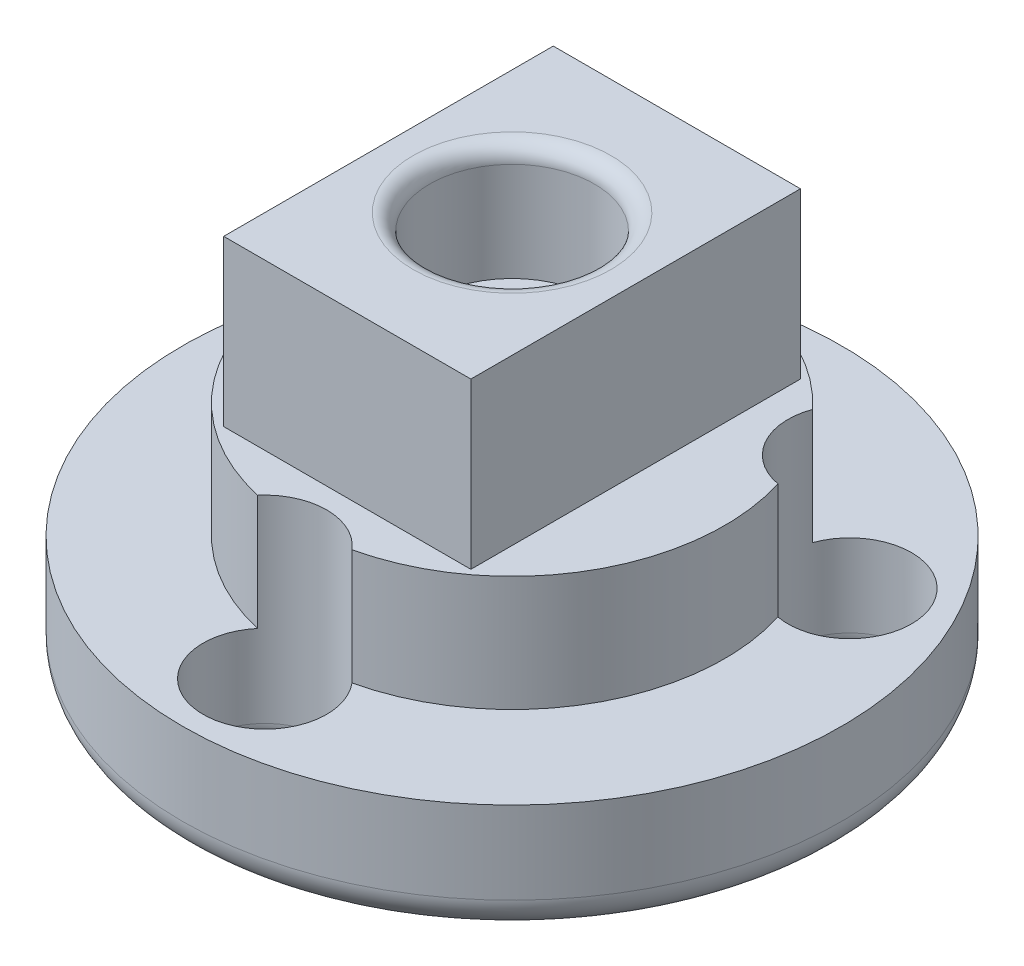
ISO-10303-21;
HEADER;
FILE_DESCRIPTION(('STEP AP214'),'2;1');
FILE_NAME('part.step','',(''),(''),'','','');
FILE_SCHEMA(('AUTOMOTIVE_DESIGN { 1 0 10303 214 1 1 1 1 }'));
ENDSEC;
DATA;
#1=APPLICATION_CONTEXT('core data for automotive mechanical design processes');
#2=APPLICATION_PROTOCOL_DEFINITION('international standard','automotive_design',2000,#1);
#3=PRODUCT_CONTEXT('',#1,'mechanical');
#4=PRODUCT('Part','Part','',(#3));
#5=PRODUCT_RELATED_PRODUCT_CATEGORY('part','',(#4));
#6=PRODUCT_DEFINITION_FORMATION('','',#4);
#7=PRODUCT_DEFINITION_CONTEXT('part definition',#1,'design');
#8=PRODUCT_DEFINITION('design','',#6,#7);
#9=PRODUCT_DEFINITION_SHAPE('','',#8);
#10=(LENGTH_UNIT() NAMED_UNIT(*) SI_UNIT(.MILLI.,.METRE.));
#11=(NAMED_UNIT(*) PLANE_ANGLE_UNIT() SI_UNIT($,.RADIAN.));
#12=(NAMED_UNIT(*) SI_UNIT($,.STERADIAN.) SOLID_ANGLE_UNIT());
#13=UNCERTAINTY_MEASURE_WITH_UNIT(LENGTH_MEASURE(1.E-05),#10,'distance_accuracy_value','');
#14=(GEOMETRIC_REPRESENTATION_CONTEXT(3) GLOBAL_UNCERTAINTY_ASSIGNED_CONTEXT((#13)) GLOBAL_UNIT_ASSIGNED_CONTEXT((#10,
#11,#12)) REPRESENTATION_CONTEXT('',''));
#15=CARTESIAN_POINT('',(0.,0.,0.));
#16=DIRECTION('',(0.,0.,1.));
#17=DIRECTION('',(1.,0.,0.));
#18=AXIS2_PLACEMENT_3D('',#15,#16,#17);
#19=CARTESIAN_POINT('',(0.,14.,0.));
#20=DIRECTION('',(0.,-1.,0.));
#21=DIRECTION('',(0.,0.,-1.));
#22=AXIS2_PLACEMENT_3D('',#19,#20,#21);
#23=CYLINDRICAL_SURFACE('',#22,12.9);
#24=CARTESIAN_POINT('',(0.,7.,0.));
#25=DIRECTION('',(0.,1.,0.));
#26=DIRECTION('',(0.,0.,1.));
#27=AXIS2_PLACEMENT_3D('',#24,#25,#26);
#28=CIRCLE('',#27,12.9);
#29=CARTESIAN_POINT('',(-12.324658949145,7.,-3.8095645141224));
#30=VERTEX_POINT('',#29);
#31=CARTESIAN_POINT('',(-2.86314982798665,7.,12.57825));
#32=VERTEX_POINT('',#31);
#33=EDGE_CURVE('E236',#30,#32,#28,.T.);
#34=ORIENTED_EDGE('',*,*,#33,.T.);
#35=DIRECTION('',(0.,-1.,0.));
#36=VECTOR('',#35,1.);
#37=CARTESIAN_POINT('',(-2.86314982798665,7.,12.57825));
#38=LINE('',#37,#36);
#39=CARTESIAN_POINT('',(-2.86314982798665,14.,12.57825));
#40=VERTEX_POINT('',#39);
#41=EDGE_CURVE('E219',#32,#40,#38,.F.);
#42=ORIENTED_EDGE('',*,*,#41,.T.);
#43=CARTESIAN_POINT('',(0.,14.,0.));
#44=DIRECTION('',(0.,1.,0.));
#45=DIRECTION('',(0.,0.,1.));
#46=AXIS2_PLACEMENT_3D('',#43,#44,#45);
#47=CIRCLE('',#46,12.9);
#48=CARTESIAN_POINT('',(-12.324658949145,14.,-3.8095645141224));
#49=VERTEX_POINT('',#48);
#50=EDGE_CURVE('E223',#49,#40,#47,.T.);
#51=ORIENTED_EDGE('',*,*,#50,.F.);
#52=DIRECTION('',(0.,-1.,0.));
#53=VECTOR('',#52,1.);
#54=CARTESIAN_POINT('',(-12.324658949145,7.,-3.8095645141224));
#55=LINE('',#54,#53);
#56=EDGE_CURVE('E189',#49,#30,#55,.T.);
#57=ORIENTED_EDGE('',*,*,#56,.T.);
#58=EDGE_LOOP('',(#34,#42,#51,#57));
#59=FACE_BOUND('',#58,.T.);
#60=ADVANCED_FACE('F45',(#59),#23,.T.);
#61=CARTESIAN_POINT('',(2.86314982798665,14.,12.57825));
#62=VERTEX_POINT('',#61);
#63=CARTESIAN_POINT('',(12.3246589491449,14.,-3.80956451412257));
#64=VERTEX_POINT('',#63);
#65=EDGE_CURVE('E224',#62,#64,#47,.T.);
#66=ORIENTED_EDGE('',*,*,#65,.F.);
#67=DIRECTION('',(0.,-1.,0.));
#68=VECTOR('',#67,1.);
#69=CARTESIAN_POINT('',(2.86314982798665,7.,12.57825));
#70=LINE('',#69,#68);
#71=CARTESIAN_POINT('',(2.86314982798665,7.,12.57825));
#72=VERTEX_POINT('',#71);
#73=EDGE_CURVE('E212',#62,#72,#70,.T.);
#74=ORIENTED_EDGE('',*,*,#73,.T.);
#75=CARTESIAN_POINT('',(12.3246589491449,7.,-3.80956451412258));
#76=VERTEX_POINT('',#75);
#77=EDGE_CURVE('E230',#72,#76,#28,.T.);
#78=ORIENTED_EDGE('',*,*,#77,.T.);
#79=DIRECTION('',(0.,-1.,0.));
#80=VECTOR('',#79,1.);
#81=CARTESIAN_POINT('',(12.3246589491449,7.,-3.80956451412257));
#82=LINE('',#81,#80);
#83=EDGE_CURVE('E208',#76,#64,#82,.F.);
#84=ORIENTED_EDGE('',*,*,#83,.T.);
#85=EDGE_LOOP('',(#66,#74,#78,#84));
#86=FACE_BOUND('',#85,.T.);
#87=ADVANCED_FACE('F319',(#86),#23,.T.);
#88=CARTESIAN_POINT('',(0.,7.,0.));
#89=DIRECTION('',(0.,-1.,0.));
#90=DIRECTION('',(0.,0.,-1.));
#91=AXIS2_PLACEMENT_3D('',#88,#89,#90);
#92=CYLINDRICAL_SURFACE('',#91,20.);
#93=CARTESIAN_POINT('',(0.,2.,0.));
#94=DIRECTION('',(0.,1.,0.));
#95=DIRECTION('',(0.,0.,1.));
#96=AXIS2_PLACEMENT_3D('',#93,#94,#95);
#97=CIRCLE('',#96,20.);
#98=CARTESIAN_POINT('',(0.,2.,20.));
#99=VERTEX_POINT('',#98);
#100=EDGE_CURVE('E11',#99,#99,#97,.T.);
#101=ORIENTED_EDGE('',*,*,#100,.T.);
#102=EDGE_LOOP('',(#101));
#103=FACE_BOUND('',#102,.T.);
#104=CARTESIAN_POINT('',(0.,7.,0.));
#105=DIRECTION('',(0.,1.,0.));
#106=DIRECTION('',(0.,0.,1.));
#107=AXIS2_PLACEMENT_3D('',#104,#105,#106);
#108=CIRCLE('',#107,20.);
#109=CARTESIAN_POINT('',(0.,7.,20.));
#110=VERTEX_POINT('',#109);
#111=EDGE_CURVE('E228',#110,#110,#108,.T.);
#112=ORIENTED_EDGE('',*,*,#111,.F.);
#113=EDGE_LOOP('',(#112));
#114=FACE_BOUND('',#113,.T.);
#115=ADVANCED_FACE('F326',(#103,#114),#92,.T.);
#116=CARTESIAN_POINT('',(0.,7.,0.));
#117=DIRECTION('',(0.,1.,0.));
#118=DIRECTION('',(0.,0.,1.));
#119=AXIS2_PLACEMENT_3D('',#116,#117,#118);
#120=PLANE('',#119);
#121=CARTESIAN_POINT('',(0.,7.,15.));
#122=DIRECTION('',(0.,1.,0.));
#123=DIRECTION('',(0.,0.,1.));
#124=AXIS2_PLACEMENT_3D('',#121,#122,#123);
#125=CIRCLE('',#124,3.75);
#126=EDGE_CURVE('E216',#32,#72,#125,.T.);
#127=ORIENTED_EDGE('',*,*,#126,.F.);
#128=ORIENTED_EDGE('',*,*,#33,.F.);
#129=CARTESIAN_POINT('',(-12.9903810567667,7.,-7.49999999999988));
#130=DIRECTION('',(0.,1.,0.));
#131=DIRECTION('',(0.,0.,1.));
#132=AXIS2_PLACEMENT_3D('',#129,#130,#131);
#133=CIRCLE('',#132,3.75);
#134=CARTESIAN_POINT('',(-9.46150912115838,7.,-8.7686854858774));
#135=VERTEX_POINT('',#134);
#136=EDGE_CURVE('E194',#135,#30,#133,.T.);
#137=ORIENTED_EDGE('',*,*,#136,.F.);
#138=CARTESIAN_POINT('',(9.46150912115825,7.,-8.76868548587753));
#139=VERTEX_POINT('',#138);
#140=EDGE_CURVE('E235',#139,#135,#28,.T.);
#141=ORIENTED_EDGE('',*,*,#140,.F.);
#142=CARTESIAN_POINT('',(12.9903810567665,7.,-7.50000000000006));
#143=DIRECTION('',(0.,1.,0.));
#144=DIRECTION('',(0.,0.,1.));
#145=AXIS2_PLACEMENT_3D('',#142,#143,#144);
#146=CIRCLE('',#145,3.75);
#147=EDGE_CURVE('E205',#76,#139,#146,.T.);
#148=ORIENTED_EDGE('',*,*,#147,.F.);
#149=ORIENTED_EDGE('',*,*,#77,.F.);
#150=EDGE_LOOP('',(#127,#128,#137,#141,#148,#149));
#151=FACE_BOUND('',#150,.T.);
#152=ORIENTED_EDGE('',*,*,#111,.T.);
#153=EDGE_LOOP('',(#152));
#154=FACE_BOUND('',#153,.T.);
#155=ADVANCED_FACE('F341',(#151,#154),#120,.T.);
#156=CARTESIAN_POINT('',(0.,0.,0.));
#157=DIRECTION('',(0.,1.,0.));
#158=DIRECTION('',(0.,0.,1.));
#159=AXIS2_PLACEMENT_3D('',#156,#157,#158);
#160=PLANE('',#159);
#161=CARTESIAN_POINT('',(0.,0.,0.));
#162=DIRECTION('',(0.,1.,0.));
#163=DIRECTION('',(0.,0.,1.));
#164=AXIS2_PLACEMENT_3D('',#161,#162,#163);
#165=CIRCLE('',#164,18.);
#166=CARTESIAN_POINT('',(17.5505065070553,0.,-3.99746436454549));
#167=VERTEX_POINT('',#166);
#168=CARTESIAN_POINT('',(5.3133475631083,0.,17.1979166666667));
#169=VERTEX_POINT('',#168);
#170=EDGE_CURVE('E67',#167,#169,#165,.F.);
#171=ORIENTED_EDGE('',*,*,#170,.T.);
#172=CARTESIAN_POINT('',(0.,0.,15.));
#173=DIRECTION('',(0.,1.,0.));
#174=DIRECTION('',(0.,0.,1.));
#175=AXIS2_PLACEMENT_3D('',#172,#173,#174);
#176=CIRCLE('',#175,5.75);
#177=CARTESIAN_POINT('',(-5.3133475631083,0.,17.1979166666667));
#178=VERTEX_POINT('',#177);
#179=EDGE_CURVE('E268',#169,#178,#176,.T.);
#180=ORIENTED_EDGE('',*,*,#179,.T.);
#181=CARTESIAN_POINT('',(0.,0.,0.));
#182=DIRECTION('',(0.,1.,0.));
#183=DIRECTION('',(0.,0.,1.));
#184=AXIS2_PLACEMENT_3D('',#181,#182,#183);
#185=CIRCLE('',#184,18.);
#186=CARTESIAN_POINT('',(-17.5505065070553,0.,-3.99746436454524));
#187=VERTEX_POINT('',#186);
#188=EDGE_CURVE('E263',#178,#187,#185,.F.);
#189=ORIENTED_EDGE('',*,*,#188,.T.);
#190=CARTESIAN_POINT('',(-12.9903810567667,0.,-7.49999999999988));
#191=DIRECTION('',(0.,1.,0.));
#192=DIRECTION('',(0.,0.,1.));
#193=AXIS2_PLACEMENT_3D('',#190,#191,#192);
#194=CIRCLE('',#193,5.75);
#195=CARTESIAN_POINT('',(-12.2371589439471,0.,-13.2004523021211));
#196=VERTEX_POINT('',#195);
#197=EDGE_CURVE('E260',#187,#196,#194,.T.);
#198=ORIENTED_EDGE('',*,*,#197,.T.);
#199=CARTESIAN_POINT('',(0.,0.,0.));
#200=DIRECTION('',(0.,1.,0.));
#201=DIRECTION('',(0.,0.,1.));
#202=AXIS2_PLACEMENT_3D('',#199,#200,#201);
#203=CIRCLE('',#202,18.);
#204=CARTESIAN_POINT('',(12.2371589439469,0.,-13.2004523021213));
#205=VERTEX_POINT('',#204);
#206=EDGE_CURVE('E254',#196,#205,#203,.F.);
#207=ORIENTED_EDGE('',*,*,#206,.T.);
#208=CARTESIAN_POINT('',(12.9903810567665,0.,-7.50000000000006));
#209=DIRECTION('',(0.,1.,0.));
#210=DIRECTION('',(0.,0.,1.));
#211=AXIS2_PLACEMENT_3D('',#208,#209,#210);
#212=CIRCLE('',#211,5.75);
#213=EDGE_CURVE('E257',#205,#167,#212,.T.);
#214=ORIENTED_EDGE('',*,*,#213,.T.);
#215=EDGE_LOOP('',(#171,#180,#189,#198,#207,#214));
#216=FACE_BOUND('',#215,.T.);
#217=ADVANCED_FACE('F333',(#216),#160,.F.);
#218=CARTESIAN_POINT('',(9.46150912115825,14.,-8.76868548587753));
#219=VERTEX_POINT('',#218);
#220=CARTESIAN_POINT('',(-9.46150912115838,14.,-8.7686854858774));
#221=VERTEX_POINT('',#220);
#222=EDGE_CURVE('E229',#219,#221,#47,.T.);
#223=ORIENTED_EDGE('',*,*,#222,.F.);
#224=DIRECTION('',(0.,-1.,0.));
#225=VECTOR('',#224,1.);
#226=CARTESIAN_POINT('',(9.46150912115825,7.,-8.76868548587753));
#227=LINE('',#226,#225);
#228=EDGE_CURVE('E201',#219,#139,#227,.T.);
#229=ORIENTED_EDGE('',*,*,#228,.T.);
#230=ORIENTED_EDGE('',*,*,#140,.T.);
#231=DIRECTION('',(0.,-1.,0.));
#232=VECTOR('',#231,1.);
#233=CARTESIAN_POINT('',(-9.46150912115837,7.,-8.7686854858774));
#234=LINE('',#233,#232);
#235=EDGE_CURVE('E197',#135,#221,#234,.F.);
#236=ORIENTED_EDGE('',*,*,#235,.T.);
#237=EDGE_LOOP('',(#223,#229,#230,#236));
#238=FACE_BOUND('',#237,.T.);
#239=ADVANCED_FACE('F322',(#238),#23,.T.);
#240=CARTESIAN_POINT('',(0.,14.,0.));
#241=DIRECTION('',(0.,1.,0.));
#242=DIRECTION('',(0.,0.,1.));
#243=AXIS2_PLACEMENT_3D('',#240,#241,#242);
#244=PLANE('',#243);
#245=DIRECTION('',(0.,0.,1.));
#246=VECTOR('',#245,1.);
#247=CARTESIAN_POINT('',(-7.5,14.,-10.));
#248=LINE('',#247,#246);
#249=CARTESIAN_POINT('',(-7.5,14.,-10.));
#250=VERTEX_POINT('',#249);
#251=CARTESIAN_POINT('',(-7.5,14.,10.));
#252=VERTEX_POINT('',#251);
#253=EDGE_CURVE('E174',#250,#252,#248,.T.);
#254=ORIENTED_EDGE('',*,*,#253,.F.);
#255=DIRECTION('',(-1.,0.,0.));
#256=VECTOR('',#255,1.);
#257=CARTESIAN_POINT('',(-7.5,14.,-10.));
#258=LINE('',#257,#256);
#259=CARTESIAN_POINT('',(7.5,14.,-10.));
#260=VERTEX_POINT('',#259);
#261=EDGE_CURVE('E171',#260,#250,#258,.T.);
#262=ORIENTED_EDGE('',*,*,#261,.F.);
#263=DIRECTION('',(0.,0.,-1.));
#264=VECTOR('',#263,1.);
#265=CARTESIAN_POINT('',(7.5,14.,-10.));
#266=LINE('',#265,#264);
#267=CARTESIAN_POINT('',(7.5,14.,10.));
#268=VERTEX_POINT('',#267);
#269=EDGE_CURVE('E419',#268,#260,#266,.T.);
#270=ORIENTED_EDGE('',*,*,#269,.F.);
#271=DIRECTION('',(1.,0.,0.));
#272=VECTOR('',#271,1.);
#273=CARTESIAN_POINT('',(-7.5,14.,10.));
#274=LINE('',#273,#272);
#275=EDGE_CURVE('E408',#252,#268,#274,.T.);
#276=ORIENTED_EDGE('',*,*,#275,.F.);
#277=EDGE_LOOP('',(#254,#262,#270,#276));
#278=FACE_BOUND('',#277,.T.);
#279=CARTESIAN_POINT('',(0.,14.,15.));
#280=DIRECTION('',(0.,1.,0.));
#281=DIRECTION('',(0.,0.,1.));
#282=AXIS2_PLACEMENT_3D('',#279,#280,#281);
#283=CIRCLE('',#282,3.75);
#284=EDGE_CURVE('E234',#62,#40,#283,.T.);
#285=ORIENTED_EDGE('',*,*,#284,.F.);
#286=ORIENTED_EDGE('',*,*,#65,.T.);
#287=CARTESIAN_POINT('',(12.9903810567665,14.,-7.50000000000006));
#288=DIRECTION('',(0.,-1.,0.));
#289=DIRECTION('',(0.,0.,-1.));
#290=AXIS2_PLACEMENT_3D('',#287,#288,#289);
#291=CIRCLE('',#290,3.75);
#292=EDGE_CURVE('E181',#64,#219,#291,.T.);
#293=ORIENTED_EDGE('',*,*,#292,.T.);
#294=ORIENTED_EDGE('',*,*,#222,.T.);
#295=CARTESIAN_POINT('',(-12.9903810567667,14.,-7.49999999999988));
#296=DIRECTION('',(0.,-1.,0.));
#297=DIRECTION('',(0.,0.,-1.));
#298=AXIS2_PLACEMENT_3D('',#295,#296,#297);
#299=CIRCLE('',#298,3.75);
#300=EDGE_CURVE('E176',#221,#49,#299,.T.);
#301=ORIENTED_EDGE('',*,*,#300,.T.);
#302=ORIENTED_EDGE('',*,*,#50,.T.);
#303=EDGE_LOOP('',(#285,#286,#293,#294,#301,#302));
#304=FACE_BOUND('',#303,.T.);
#305=ADVANCED_FACE('F332',(#278,#304),#244,.T.);
#306=CARTESIAN_POINT('',(-12.9903810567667,14.,-7.49999999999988));
#307=DIRECTION('',(0.,-1.,0.));
#308=DIRECTION('',(0.,0.,-1.));
#309=AXIS2_PLACEMENT_3D('',#306,#307,#308);
#310=CYLINDRICAL_SURFACE('',#309,3.75);
#311=CARTESIAN_POINT('',(-12.9903810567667,2.,-7.49999999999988));
#312=DIRECTION('',(0.,1.,0.));
#313=DIRECTION('',(0.,0.,1.));
#314=AXIS2_PLACEMENT_3D('',#311,#312,#313);
#315=CIRCLE('',#314,3.75);
#316=CARTESIAN_POINT('',(-12.9903810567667,2.,-3.74999999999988));
#317=VERTEX_POINT('',#316);
#318=EDGE_CURVE('E271',#317,#317,#315,.F.);
#319=ORIENTED_EDGE('',*,*,#318,.T.);
#320=EDGE_LOOP('',(#319));
#321=FACE_BOUND('',#320,.T.);
#322=ORIENTED_EDGE('',*,*,#136,.T.);
#323=ORIENTED_EDGE('',*,*,#56,.F.);
#324=ORIENTED_EDGE('',*,*,#300,.F.);
#325=ORIENTED_EDGE('',*,*,#235,.F.);
#326=EDGE_LOOP('',(#322,#323,#324,#325));
#327=FACE_BOUND('',#326,.T.);
#328=ADVANCED_FACE('F339',(#321,#327),#310,.F.);
#329=CARTESIAN_POINT('',(12.9903810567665,14.,-7.50000000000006));
#330=DIRECTION('',(0.,-1.,0.));
#331=DIRECTION('',(0.,0.,-1.));
#332=AXIS2_PLACEMENT_3D('',#329,#330,#331);
#333=CYLINDRICAL_SURFACE('',#332,3.75);
#334=CARTESIAN_POINT('',(12.9903810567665,2.,-7.50000000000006));
#335=DIRECTION('',(0.,1.,0.));
#336=DIRECTION('',(0.,0.,1.));
#337=AXIS2_PLACEMENT_3D('',#334,#335,#336);
#338=CIRCLE('',#337,3.75);
#339=CARTESIAN_POINT('',(12.9903810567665,2.,-3.75000000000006));
#340=VERTEX_POINT('',#339);
#341=EDGE_CURVE('E59',#340,#340,#338,.F.);
#342=ORIENTED_EDGE('',*,*,#341,.T.);
#343=EDGE_LOOP('',(#342));
#344=FACE_BOUND('',#343,.T.);
#345=ORIENTED_EDGE('',*,*,#147,.T.);
#346=ORIENTED_EDGE('',*,*,#228,.F.);
#347=ORIENTED_EDGE('',*,*,#292,.F.);
#348=ORIENTED_EDGE('',*,*,#83,.F.);
#349=EDGE_LOOP('',(#345,#346,#347,#348));
#350=FACE_BOUND('',#349,.T.);
#351=ADVANCED_FACE('F364',(#344,#350),#333,.F.);
#352=CARTESIAN_POINT('',(0.,14.,15.));
#353=DIRECTION('',(0.,-1.,0.));
#354=DIRECTION('',(0.,0.,-1.));
#355=AXIS2_PLACEMENT_3D('',#352,#353,#354);
#356=CYLINDRICAL_SURFACE('',#355,3.75);
#357=CARTESIAN_POINT('',(0.,2.,15.));
#358=DIRECTION('',(0.,1.,0.));
#359=DIRECTION('',(0.,0.,1.));
#360=AXIS2_PLACEMENT_3D('',#357,#358,#359);
#361=CIRCLE('',#360,3.75);
#362=CARTESIAN_POINT('',(0.,2.,18.75));
#363=VERTEX_POINT('',#362);
#364=EDGE_CURVE('E250',#363,#363,#361,.F.);
#365=ORIENTED_EDGE('',*,*,#364,.T.);
#366=EDGE_LOOP('',(#365));
#367=FACE_BOUND('',#366,.T.);
#368=ORIENTED_EDGE('',*,*,#126,.T.);
#369=ORIENTED_EDGE('',*,*,#73,.F.);
#370=ORIENTED_EDGE('',*,*,#284,.T.);
#371=ORIENTED_EDGE('',*,*,#41,.F.);
#372=EDGE_LOOP('',(#368,#369,#370,#371));
#373=FACE_BOUND('',#372,.T.);
#374=ADVANCED_FACE('F357',(#367,#373),#356,.F.);
#375=CARTESIAN_POINT('',(-7.5,24.,-10.));
#376=DIRECTION('',(1.,0.,0.));
#377=DIRECTION('',(0.,0.,-1.));
#378=AXIS2_PLACEMENT_3D('',#375,#376,#377);
#379=PLANE('',#378);
#380=ORIENTED_EDGE('',*,*,#253,.T.);
#381=DIRECTION('',(0.,-1.,0.));
#382=VECTOR('',#381,1.);
#383=CARTESIAN_POINT('',(-7.5,24.,10.));
#384=LINE('',#383,#382);
#385=CARTESIAN_POINT('',(-7.5,24.,10.));
#386=VERTEX_POINT('',#385);
#387=EDGE_CURVE('E153',#386,#252,#384,.T.);
#388=ORIENTED_EDGE('',*,*,#387,.F.);
#389=DIRECTION('',(0.,0.,1.));
#390=VECTOR('',#389,1.);
#391=CARTESIAN_POINT('',(-7.5,24.,-10.));
#392=LINE('',#391,#390);
#393=CARTESIAN_POINT('',(-7.5,24.,-10.));
#394=VERTEX_POINT('',#393);
#395=EDGE_CURVE('E161',#394,#386,#392,.T.);
#396=ORIENTED_EDGE('',*,*,#395,.F.);
#397=DIRECTION('',(0.,-1.,0.));
#398=VECTOR('',#397,1.);
#399=CARTESIAN_POINT('',(-7.5,24.,-10.));
#400=LINE('',#399,#398);
#401=EDGE_CURVE('E415',#394,#250,#400,.T.);
#402=ORIENTED_EDGE('',*,*,#401,.T.);
#403=EDGE_LOOP('',(#380,#388,#396,#402));
#404=FACE_BOUND('',#403,.T.);
#405=ADVANCED_FACE('F173',(#404),#379,.F.);
#406=CARTESIAN_POINT('',(-7.5,24.,10.));
#407=DIRECTION('',(0.,0.,-1.));
#408=DIRECTION('',(-1.,0.,0.));
#409=AXIS2_PLACEMENT_3D('',#406,#407,#408);
#410=PLANE('',#409);
#411=ORIENTED_EDGE('',*,*,#275,.T.);
#412=DIRECTION('',(0.,-1.,0.));
#413=VECTOR('',#412,1.);
#414=CARTESIAN_POINT('',(7.5,24.,10.));
#415=LINE('',#414,#413);
#416=CARTESIAN_POINT('',(7.5,24.,10.));
#417=VERTEX_POINT('',#416);
#418=EDGE_CURVE('E156',#417,#268,#415,.T.);
#419=ORIENTED_EDGE('',*,*,#418,.F.);
#420=DIRECTION('',(1.,0.,0.));
#421=VECTOR('',#420,1.);
#422=CARTESIAN_POINT('',(-7.5,24.,10.));
#423=LINE('',#422,#421);
#424=EDGE_CURVE('E148',#386,#417,#423,.T.);
#425=ORIENTED_EDGE('',*,*,#424,.F.);
#426=ORIENTED_EDGE('',*,*,#387,.T.);
#427=EDGE_LOOP('',(#411,#419,#425,#426));
#428=FACE_BOUND('',#427,.T.);
#429=ADVANCED_FACE('F151',(#428),#410,.F.);
#430=CARTESIAN_POINT('',(7.5,24.,-10.));
#431=DIRECTION('',(-1.,0.,0.));
#432=DIRECTION('',(0.,0.,1.));
#433=AXIS2_PLACEMENT_3D('',#430,#431,#432);
#434=PLANE('',#433);
#435=ORIENTED_EDGE('',*,*,#269,.T.);
#436=DIRECTION('',(0.,-1.,0.));
#437=VECTOR('',#436,1.);
#438=CARTESIAN_POINT('',(7.5,24.,-10.));
#439=LINE('',#438,#437);
#440=CARTESIAN_POINT('',(7.5,24.,-10.));
#441=VERTEX_POINT('',#440);
#442=EDGE_CURVE('E183',#441,#260,#439,.T.);
#443=ORIENTED_EDGE('',*,*,#442,.F.);
#444=DIRECTION('',(0.,0.,-1.));
#445=VECTOR('',#444,1.);
#446=CARTESIAN_POINT('',(7.5,24.,-10.));
#447=LINE('',#446,#445);
#448=EDGE_CURVE('E160',#417,#441,#447,.T.);
#449=ORIENTED_EDGE('',*,*,#448,.F.);
#450=ORIENTED_EDGE('',*,*,#418,.T.);
#451=EDGE_LOOP('',(#435,#443,#449,#450));
#452=FACE_BOUND('',#451,.T.);
#453=ADVANCED_FACE('F381',(#452),#434,.F.);
#454=CARTESIAN_POINT('',(-7.5,24.,-10.));
#455=DIRECTION('',(0.,0.,1.));
#456=DIRECTION('',(1.,0.,0.));
#457=AXIS2_PLACEMENT_3D('',#454,#455,#456);
#458=PLANE('',#457);
#459=ORIENTED_EDGE('',*,*,#261,.T.);
#460=ORIENTED_EDGE('',*,*,#401,.F.);
#461=DIRECTION('',(-1.,0.,0.));
#462=VECTOR('',#461,1.);
#463=CARTESIAN_POINT('',(-7.5,24.,-10.));
#464=LINE('',#463,#462);
#465=EDGE_CURVE('E166',#441,#394,#464,.T.);
#466=ORIENTED_EDGE('',*,*,#465,.F.);
#467=ORIENTED_EDGE('',*,*,#442,.T.);
#468=EDGE_LOOP('',(#459,#460,#466,#467));
#469=FACE_BOUND('',#468,.T.);
#470=ADVANCED_FACE('F384',(#469),#458,.F.);
#471=CARTESIAN_POINT('',(0.,24.,0.));
#472=DIRECTION('',(0.,1.,0.));
#473=DIRECTION('',(0.,0.,1.));
#474=AXIS2_PLACEMENT_3D('',#471,#472,#473);
#475=PLANE('',#474);
#476=CARTESIAN_POINT('',(0.,24.,0.));
#477=DIRECTION('',(0.,1.,0.));
#478=DIRECTION('',(0.,0.,1.));
#479=AXIS2_PLACEMENT_3D('',#476,#477,#478);
#480=CIRCLE('',#479,6.);
#481=CARTESIAN_POINT('',(0.,24.,6.));
#482=VERTEX_POINT('',#481);
#483=EDGE_CURVE('E246',#482,#482,#480,.F.);
#484=ORIENTED_EDGE('',*,*,#483,.T.);
#485=EDGE_LOOP('',(#484));
#486=FACE_BOUND('',#485,.T.);
#487=ORIENTED_EDGE('',*,*,#395,.T.);
#488=ORIENTED_EDGE('',*,*,#424,.T.);
#489=ORIENTED_EDGE('',*,*,#448,.T.);
#490=ORIENTED_EDGE('',*,*,#465,.T.);
#491=EDGE_LOOP('',(#487,#488,#489,#490));
#492=FACE_BOUND('',#491,.T.);
#493=ADVANCED_FACE('F164',(#486,#492),#475,.T.);
#494=CARTESIAN_POINT('',(0.,17.,0.));
#495=DIRECTION('',(0.,1.,0.));
#496=DIRECTION('',(0.,0.,1.));
#497=AXIS2_PLACEMENT_3D('',#494,#495,#496);
#498=CYLINDRICAL_SURFACE('',#497,5.);
#499=CARTESIAN_POINT('',(0.,23.,0.));
#500=DIRECTION('',(0.,1.,0.));
#501=DIRECTION('',(0.,0.,1.));
#502=AXIS2_PLACEMENT_3D('',#499,#500,#501);
#503=CIRCLE('',#502,5.);
#504=CARTESIAN_POINT('',(0.,23.,5.));
#505=VERTEX_POINT('',#504);
#506=EDGE_CURVE('E242',#505,#505,#503,.T.);
#507=ORIENTED_EDGE('',*,*,#506,.T.);
#508=EDGE_LOOP('',(#507));
#509=FACE_BOUND('',#508,.T.);
#510=CARTESIAN_POINT('',(0.,17.,0.));
#511=DIRECTION('',(0.,1.,0.));
#512=DIRECTION('',(0.,0.,1.));
#513=AXIS2_PLACEMENT_3D('',#510,#511,#512);
#514=CIRCLE('',#513,5.);
#515=CARTESIAN_POINT('',(0.,17.,5.));
#516=VERTEX_POINT('',#515);
#517=EDGE_CURVE('E402',#516,#516,#514,.T.);
#518=ORIENTED_EDGE('',*,*,#517,.F.);
#519=EDGE_LOOP('',(#518));
#520=FACE_BOUND('',#519,.T.);
#521=ADVANCED_FACE('F391',(#509,#520),#498,.F.);
#522=CARTESIAN_POINT('',(0.,17.,0.));
#523=DIRECTION('',(0.,1.,0.));
#524=DIRECTION('',(0.,0.,1.));
#525=AXIS2_PLACEMENT_3D('',#522,#523,#524);
#526=PLANE('',#525);
#527=ORIENTED_EDGE('',*,*,#517,.T.);
#528=EDGE_LOOP('',(#527));
#529=FACE_BOUND('',#528,.T.);
#530=ADVANCED_FACE('F314',(#529),#526,.T.);
#531=CARTESIAN_POINT('',(0.,23.,0.));
#532=DIRECTION('',(0.,1.,0.));
#533=DIRECTION('',(0.,0.,1.));
#534=AXIS2_PLACEMENT_3D('',#531,#532,#533);
#535=TOROIDAL_SURFACE('',#534,6.,1.);
#536=ORIENTED_EDGE('',*,*,#483,.F.);
#537=EDGE_LOOP('',(#536));
#538=FACE_BOUND('',#537,.T.);
#539=ORIENTED_EDGE('',*,*,#506,.F.);
#540=EDGE_LOOP('',(#539));
#541=FACE_BOUND('',#540,.T.);
#542=ADVANCED_FACE('F309',(#538,#541),#535,.T.);
#543=CARTESIAN_POINT('',(-12.9903810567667,2.,-7.49999999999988));
#544=DIRECTION('',(0.,1.,0.));
#545=DIRECTION('',(0.,0.,1.));
#546=AXIS2_PLACEMENT_3D('',#543,#544,#545);
#547=TOROIDAL_SURFACE('',#546,5.75,2.);
#548=ORIENTED_EDGE('',*,*,#318,.F.);
#549=EDGE_LOOP('',(#548));
#550=FACE_BOUND('',#549,.T.);
#551=CARTESIAN_POINT('',(-17.5505065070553,0.,-3.99746436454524));
#552=CARTESIAN_POINT('',(-17.5512330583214,2.03152041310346E-09,-4.00078328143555));
#553=CARTESIAN_POINT('',(-17.5519578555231,1.56900906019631E-06,-4.00410260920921));
#554=CARTESIAN_POINT('',(-17.5994595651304,0.00020698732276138,-4.22219958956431));
#555=CARTESIAN_POINT('',(-17.6388881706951,0.00693803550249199,-4.43868291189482));
#556=CARTESIAN_POINT('',(-17.7020312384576,0.0306652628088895,-4.87347104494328));
#557=CARTESIAN_POINT('',(-17.7257319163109,0.0476704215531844,-5.09177728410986));
#558=CARTESIAN_POINT('',(-17.7566702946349,0.0893711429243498,-5.52973100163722));
#559=CARTESIAN_POINT('',(-17.7638403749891,0.114097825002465,-5.74938031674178));
#560=CARTESIAN_POINT('',(-17.7608477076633,0.168464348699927,-6.18795240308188));
#561=CARTESIAN_POINT('',(-17.7506841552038,0.19810441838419,-6.40687514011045));
#562=CARTESIAN_POINT('',(-17.7121315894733,0.259800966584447,-6.84625476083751));
#563=CARTESIAN_POINT('',(-17.6834635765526,0.291887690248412,-7.06668313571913));
#564=CARTESIAN_POINT('',(-17.6070636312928,0.354604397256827,-7.50448157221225));
#565=CARTESIAN_POINT('',(-17.5593291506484,0.385234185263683,-7.72185122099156));
#566=CARTESIAN_POINT('',(-17.444595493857,0.441091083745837,-8.1511388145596));
#567=CARTESIAN_POINT('',(-17.3776842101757,0.466341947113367,-8.36307693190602));
#568=CARTESIAN_POINT('',(-17.2243578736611,0.507839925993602,-8.78068105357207));
#569=CARTESIAN_POINT('',(-17.1379496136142,0.524090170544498,-8.98634921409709));
#570=CARTESIAN_POINT('',(-16.9534815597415,0.543943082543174,-9.3735698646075));
#571=CARTESIAN_POINT('',(-16.8568472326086,0.548429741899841,-9.55575494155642));
#572=CARTESIAN_POINT('',(-16.6481901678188,0.546596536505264,-9.91102781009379));
#573=CARTESIAN_POINT('',(-16.536167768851,0.540276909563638,-10.0841158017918));
#574=CARTESIAN_POINT('',(-16.2976555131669,0.517830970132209,-10.420051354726));
#575=CARTESIAN_POINT('',(-16.1711247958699,0.501676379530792,-10.582867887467));
#576=CARTESIAN_POINT('',(-15.9052178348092,0.461936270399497,-10.8966614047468));
#577=CARTESIAN_POINT('',(-15.7658390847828,0.438349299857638,-11.0476360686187));
#578=CARTESIAN_POINT('',(-15.4633747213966,0.384569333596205,-11.3492699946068));
#579=CARTESIAN_POINT('',(-15.2992813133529,0.353988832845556,-11.498846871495));
#580=CARTESIAN_POINT('',(-14.9589288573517,0.291389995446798,-11.7831214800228));
#581=CARTESIAN_POINT('',(-14.7826678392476,0.259371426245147,-11.9178167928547));
#582=CARTESIAN_POINT('',(-14.4195470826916,0.197382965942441,-12.1720387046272));
#583=CARTESIAN_POINT('',(-14.2327014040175,0.167410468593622,-12.2915847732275));
#584=CARTESIAN_POINT('',(-13.849587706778,0.112557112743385,-12.5156245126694));
#585=CARTESIAN_POINT('',(-13.6533240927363,0.0876739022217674,-12.6201251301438));
#586=CARTESIAN_POINT('',(-13.2585185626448,0.0464380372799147,-12.8113157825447));
#587=CARTESIAN_POINT('',(-13.0602073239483,0.0298591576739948,-12.8984340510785));
#588=CARTESIAN_POINT('',(-12.65759381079,0.00674917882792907,-13.0584789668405));
#589=CARTESIAN_POINT('',(-12.4533002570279,0.000204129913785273,-13.1314251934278));
#590=CARTESIAN_POINT('',(-12.2436335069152,1.56894978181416E-06,-13.1983900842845));
#591=CARTESIAN_POINT('',(-12.2403964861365,1.97100317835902E-09,-13.1994220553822));
#592=CARTESIAN_POINT('',(-12.2371589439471,0.,-13.2004523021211));
#593=B_SPLINE_CURVE_WITH_KNOTS('',3,(#551,#552,#553,#554,#555,#556,#557,#558,#559,#560,#561,
#562,#563,#564,#565,#566,#567,#568,#569,#570,#571,#572,#573,#574,#575,#576,#577,#578,#579,#580,
#581,#582,#583,#584,#585,#586,#587,#588,#589,#590,#591,#592),.UNSPECIFIED.,.F.,.F.,(4,2,2,2,2,2,
2,2,2,2,2,2,2,2,2,2,2,2,2,2,4),(0.,0.0101926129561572,0.669625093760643,1.32963475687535,
1.99233950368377,2.65507501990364,3.32804396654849,4.00110288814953,4.67112502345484,
5.3409140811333,5.95870137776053,6.5764750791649,7.19603348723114,7.81571300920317,
8.48721862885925,9.1588332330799,9.82957573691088,10.5000075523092,11.1510189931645,
11.8011245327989,11.811317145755),.UNSPECIFIED.);
#594=EDGE_CURVE('E49',#196,#187,#593,.F.);
#595=ORIENTED_EDGE('',*,*,#594,.F.);
#596=ORIENTED_EDGE('',*,*,#197,.F.);
#597=EDGE_LOOP('',(#595,#596));
#598=FACE_BOUND('',#597,.T.);
#599=ADVANCED_FACE('F304',(#550,#598),#547,.T.);
#600=CARTESIAN_POINT('',(12.9903810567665,2.,-7.50000000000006));
#601=DIRECTION('',(0.,1.,0.));
#602=DIRECTION('',(0.,0.,1.));
#603=AXIS2_PLACEMENT_3D('',#600,#601,#602);
#604=TOROIDAL_SURFACE('',#603,5.75,2.);
#605=ORIENTED_EDGE('',*,*,#341,.F.);
#606=EDGE_LOOP('',(#605));
#607=FACE_BOUND('',#606,.T.);
#608=CARTESIAN_POINT('',(12.2371589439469,0.,-13.2004523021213));
#609=CARTESIAN_POINT('',(12.24039648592,2.03152023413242E-09,-13.1994220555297));
#610=CARTESIAN_POINT('',(12.2436335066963,1.56900905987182E-06,-13.1983900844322));
#611=CARTESIAN_POINT('',(12.4562618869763,0.000206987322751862,-13.1304792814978));
#612=CARTESIAN_POINT('',(12.6634562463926,0.00693803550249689,-13.0563837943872));
#613=CARTESIAN_POINT('',(13.0715653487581,0.030665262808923,-12.8936732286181));
#614=CARTESIAN_POINT('',(13.2724744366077,0.0476704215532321,-12.8050454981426));
#615=CARTESIAN_POINT('',(13.6672226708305,0.0893711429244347,-12.6128620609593));
#616=CARTESIAN_POINT('',(13.861029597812,0.114097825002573,-12.5092468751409));
#617=CARTESIAN_POINT('',(14.2393478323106,0.16846434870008,-12.2873691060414));
#618=CARTESIAN_POINT('',(14.4238587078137,0.198104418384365,-12.1691058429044));
#619=CARTESIAN_POINT('',(14.7850963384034,0.259800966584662,-11.916028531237));
#620=CARTESIAN_POINT('',(14.9616589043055,0.291887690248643,-11.7809871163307));
#621=CARTESIAN_POINT('',(15.3026034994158,0.354604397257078,-11.4959236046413));
#622=CARTESIAN_POINT('',(15.4669838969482,0.38523418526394,-11.345899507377));
#623=CARTESIAN_POINT('',(15.781391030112,0.44109108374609,-11.0318934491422));
#624=CARTESIAN_POINT('',(15.9314791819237,0.466341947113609,-10.8679775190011));
#625=CARTESIAN_POINT('',(16.2164717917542,0.507839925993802,-10.5263909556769));
#626=CARTESIAN_POINT('',(16.3513815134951,0.524090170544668,-10.3487251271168));
#627=CARTESIAN_POINT('',(16.5944904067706,0.543943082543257,-9.99536078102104));
#628=CARTESIAN_POINT('',(16.7039501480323,0.548429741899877,-9.82058046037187));
#629=CARTESIAN_POINT('',(16.907296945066,0.546596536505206,-9.46224170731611));
#630=CARTESIAN_POINT('',(17.0011843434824,0.540276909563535,-9.27868346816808));
#631=CARTESIAN_POINT('',(17.1728569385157,0.517830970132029,-8.90415801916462));
#632=CARTESIAN_POINT('',(17.2505948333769,0.501676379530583,-8.7131709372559));
#633=CARTESIAN_POINT('',(17.3893945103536,0.461936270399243,-8.32599199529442));
#634=CARTESIAN_POINT('',(17.4504530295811,0.438349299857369,-8.12979912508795));
#635=CARTESIAN_POINT('',(17.5604434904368,0.384569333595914,-7.71704033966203));
#636=CARTESIAN_POINT('',(17.6079341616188,0.353988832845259,-7.50014284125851));
#637=CARTESIAN_POINT('',(17.683946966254,0.291389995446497,-7.06325166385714));
#638=CARTESIAN_POINT('',(17.7124660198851,0.259371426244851,-6.84325748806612));
#639=CARTESIAN_POINT('',(17.7510682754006,0.197382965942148,-6.40167473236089));
#640=CARTESIAN_POINT('',(17.7611753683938,0.16741046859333,-6.18008859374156));
#641=CARTESIAN_POINT('',(17.7636426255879,0.112557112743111,-5.7362825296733));
#642=CARTESIAN_POINT('',(17.7560110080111,0.0876739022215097,-5.51406294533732));
#643=CARTESIAN_POINT('',(17.7241842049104,0.046438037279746,-5.07655600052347));
#644=CARTESIAN_POINT('',(17.7004752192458,0.0298591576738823,-4.86125429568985));
#645=CARTESIAN_POINT('',(17.6377714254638,0.00674917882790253,-4.4325583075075));
#646=CARTESIAN_POINT('',(17.5987979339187,0.000204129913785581,-4.2191617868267));
#647=CARTESIAN_POINT('',(17.5519578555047,1.56894978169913E-06,-4.00410260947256));
#648=CARTESIAN_POINT('',(17.5512330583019,1.97100305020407E-09,-4.00078328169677));
#649=CARTESIAN_POINT('',(17.5505065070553,0.,-3.99746436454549));
#650=B_SPLINE_CURVE_WITH_KNOTS('',3,(#608,#609,#610,#611,#612,#613,#614,#615,#616,#617,#618,
#619,#620,#621,#622,#623,#624,#625,#626,#627,#628,#629,#630,#631,#632,#633,#634,#635,#636,#637,
#638,#639,#640,#641,#642,#643,#644,#645,#646,#647,#648,#649),.UNSPECIFIED.,.F.,.F.,(4,2,2,2,2,2,
2,2,2,2,2,2,2,2,2,2,2,2,2,2,4),(0.,0.0101926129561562,0.669625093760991,1.32963475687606,
1.99233950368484,2.65507501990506,3.32804396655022,4.00110288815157,4.67112502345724,
5.34091408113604,5.9587013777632,6.5764750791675,7.19603348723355,7.81571300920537,
8.48721862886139,9.15883323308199,9.8295757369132,10.5000075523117,11.1510189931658,
11.8011245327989,11.811317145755),.UNSPECIFIED.);
#651=EDGE_CURVE('E285',#167,#205,#650,.F.);
#652=ORIENTED_EDGE('',*,*,#651,.F.);
#653=ORIENTED_EDGE('',*,*,#213,.F.);
#654=EDGE_LOOP('',(#652,#653));
#655=FACE_BOUND('',#654,.T.);
#656=ADVANCED_FACE('F299',(#607,#655),#604,.T.);
#657=CARTESIAN_POINT('',(0.,2.,0.));
#658=DIRECTION('',(0.,1.,0.));
#659=DIRECTION('',(0.,0.,1.));
#660=AXIS2_PLACEMENT_3D('',#657,#658,#659);
#661=TOROIDAL_SURFACE('',#660,18.,2.);
#662=ORIENTED_EDGE('',*,*,#100,.F.);
#663=EDGE_LOOP('',(#662));
#664=FACE_BOUND('',#663,.T.);
#665=CARTESIAN_POINT('',(5.3133475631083,0.,17.1979166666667));
#666=CARTESIAN_POINT('',(5.31083657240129,2.03148894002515E-09,17.2002053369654));
#667=CARTESIAN_POINT('',(5.30832434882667,1.56900904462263E-06,17.2024926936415));
#668=CARTESIAN_POINT('',(5.14319767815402,0.000206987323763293,17.3526788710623));
#669=CARTESIAN_POINT('',(4.9754319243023,0.00693803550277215,17.4950667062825));
#670=CARTESIAN_POINT('',(4.6304658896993,0.030665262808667,17.7671442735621));
#671=CARTESIAN_POINT('',(4.45325747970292,0.0476704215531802,17.8968227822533));
#672=CARTESIAN_POINT('',(4.08944762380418,0.0893711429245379,18.1425930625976));
#673=CARTESIAN_POINT('',(3.90281077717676,0.114097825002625,18.2586271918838));
#674=CARTESIAN_POINT('',(3.52149987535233,0.168464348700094,18.4753215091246));
#675=CARTESIAN_POINT('',(3.32682544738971,0.198104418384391,18.5759809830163));
#676=CARTESIAN_POINT('',(2.92703525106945,0.2598009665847,18.7622832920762));
#677=CARTESIAN_POINT('',(2.72180467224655,0.291887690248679,18.8476702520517));
#678=CARTESIAN_POINT('',(2.30446013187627,0.354604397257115,19.0004051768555));
#679=CARTESIAN_POINT('',(2.09234525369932,0.385234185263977,19.0677507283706));
#680=CARTESIAN_POINT('',(1.66320446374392,0.441091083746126,19.183032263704));
#681=CARTESIAN_POINT('',(1.44620502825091,0.466341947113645,19.2310544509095));
#682=CARTESIAN_POINT('',(1.00788608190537,0.507839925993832,19.3070720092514));
#683=CARTESIAN_POINT('',(0.786568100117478,0.524090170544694,19.3350743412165));
#684=CARTESIAN_POINT('',(0.358991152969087,0.543943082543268,19.3689306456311));
#685=CARTESIAN_POINT('',(0.152897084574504,0.548429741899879,19.3763354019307));
#686=CARTESIAN_POINT('',(-0.259106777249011,0.546596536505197,19.3732695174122));
#687=CARTESIAN_POINT('',(-0.465016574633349,0.540276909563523,19.3627992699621));
#688=CARTESIAN_POINT('',(-0.875201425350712,0.517830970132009,19.3242093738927));
#689=CARTESIAN_POINT('',(-1.07947003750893,0.501676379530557,19.2960388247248));
#690=CARTESIAN_POINT('',(-1.48417667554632,0.461936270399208,19.222653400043));
#691=CARTESIAN_POINT('',(-1.6846139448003,0.438349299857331,19.1774351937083));
#692=CARTESIAN_POINT('',(-2.09706876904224,0.384569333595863,19.0663103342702));
#693=CARTESIAN_POINT('',(-2.30865284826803,0.353988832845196,18.9989897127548));
#694=CARTESIAN_POINT('',(-2.72501810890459,0.29138999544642,18.8463731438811));
#695=CARTESIAN_POINT('',(-2.92979818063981,0.25937142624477,18.7610742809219));
#696=CARTESIAN_POINT('',(-3.33152119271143,0.197382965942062,18.5737134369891));
#697=CARTESIAN_POINT('',(-3.52847396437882,0.16741046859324,18.47167336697));
#698=CARTESIAN_POINT('',(-3.91405491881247,0.11255711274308,18.2519070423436));
#699=CARTESIAN_POINT('',(-4.10268691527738,0.087673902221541,18.1341880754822));
#700=CARTESIAN_POINT('',(-4.46566564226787,0.0464380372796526,17.8878717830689));
#701=CARTESIAN_POINT('',(-4.64026789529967,0.0298591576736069,17.7596883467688));
#702=CARTESIAN_POINT('',(-4.9801776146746,0.00674917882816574,17.4910372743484));
#703=CARTESIAN_POINT('',(-5.14549767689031,0.000204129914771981,17.3505869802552));
#704=CARTESIAN_POINT('',(-5.3083243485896,1.56894976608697E-06,17.2024926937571));
#705=CARTESIAN_POINT('',(-5.31083657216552,1.97097155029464E-09,17.200205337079));
#706=CARTESIAN_POINT('',(-5.3133475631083,0.,17.1979166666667));
#707=B_SPLINE_CURVE_WITH_KNOTS('',3,(#665,#666,#667,#668,#669,#670,#671,#672,#673,#674,#675,
#676,#677,#678,#679,#680,#681,#682,#683,#684,#685,#686,#687,#688,#689,#690,#691,#692,#693,#694,
#695,#696,#697,#698,#699,#700,#701,#702,#703,#704,#705,#706),.UNSPECIFIED.,.F.,.F.,(4,2,2,2,2,2,
2,2,2,2,2,2,2,2,2,2,2,2,2,2,4),(0.,0.0101926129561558,0.669625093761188,1.32963475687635,
1.9923395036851,2.65507501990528,3.32804396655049,4.00110288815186,4.6711250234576,
5.34091408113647,5.95870137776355,6.57647507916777,7.19603348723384,7.8157130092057,
8.48721862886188,9.15883323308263,9.82957573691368,10.5000075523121,11.1510189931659,
11.8011245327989,11.811317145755),.UNSPECIFIED.);
#708=EDGE_CURVE('E73',#169,#178,#707,.T.);
#709=ORIENTED_EDGE('',*,*,#708,.F.);
#710=ORIENTED_EDGE('',*,*,#170,.F.);
#711=ORIENTED_EDGE('',*,*,#651,.T.);
#712=ORIENTED_EDGE('',*,*,#206,.F.);
#713=ORIENTED_EDGE('',*,*,#594,.T.);
#714=ORIENTED_EDGE('',*,*,#188,.F.);
#715=EDGE_LOOP('',(#709,#710,#711,#712,#713,#714));
#716=FACE_BOUND('',#715,.T.);
#717=ADVANCED_FACE('F294',(#664,#716),#661,.T.);
#718=CARTESIAN_POINT('',(0.,2.,15.));
#719=DIRECTION('',(0.,1.,0.));
#720=DIRECTION('',(0.,0.,1.));
#721=AXIS2_PLACEMENT_3D('',#718,#719,#720);
#722=TOROIDAL_SURFACE('',#721,5.75,2.);
#723=ORIENTED_EDGE('',*,*,#179,.F.);
#724=ORIENTED_EDGE('',*,*,#708,.T.);
#725=EDGE_LOOP('',(#723,#724));
#726=FACE_BOUND('',#725,.T.);
#727=ORIENTED_EDGE('',*,*,#364,.F.);
#728=EDGE_LOOP('',(#727));
#729=FACE_BOUND('',#728,.T.);
#730=ADVANCED_FACE('F298',(#726,#729),#722,.T.);
#731=CLOSED_SHELL('',(#60,#87,#115,#155,#217,#239,#305,#328,#351,#374,#405,#429,#453,#470,#493,
#521,#530,#542,#599,#656,#717,#730));
#732=MANIFOLD_SOLID_BREP('B2',#731);
#733=ADVANCED_BREP_SHAPE_REPRESENTATION('',(#18,#732),#14);
#734=SHAPE_DEFINITION_REPRESENTATION(#9,#733);
ENDSEC;
END-ISO-10303-21;
